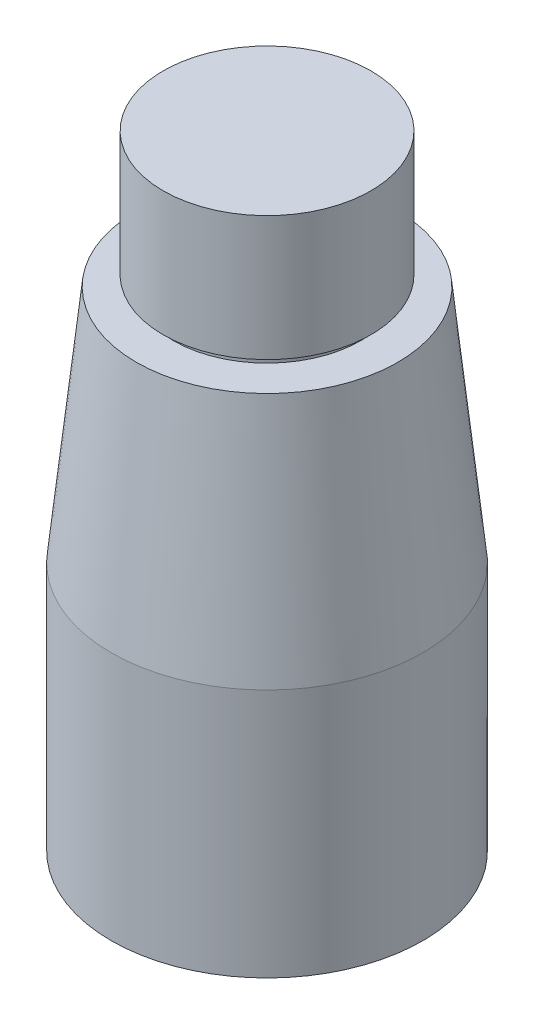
from build123d import *


with BuildPart() as part:
    # Sketch1 → Revolve1 (revolve)
    with BuildSketch(Plane.XY, mode=Mode.PRIVATE) as revolve1_sk:
        Polygon((0, 0), (-15, 0), (-15, 24), (-12.582602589, 47), (-9, 47), (-9, 48), (-10, 48), (-10, 60), (0, 60), align=None)
    revolve(revolve1_sk.sketch.rotate(Axis((0, 85.10264496, 0), (0, -1, 0)), 270), axis=Axis((0, 85.10264496, 0), (0, -1, 0)))


solid = part.part
